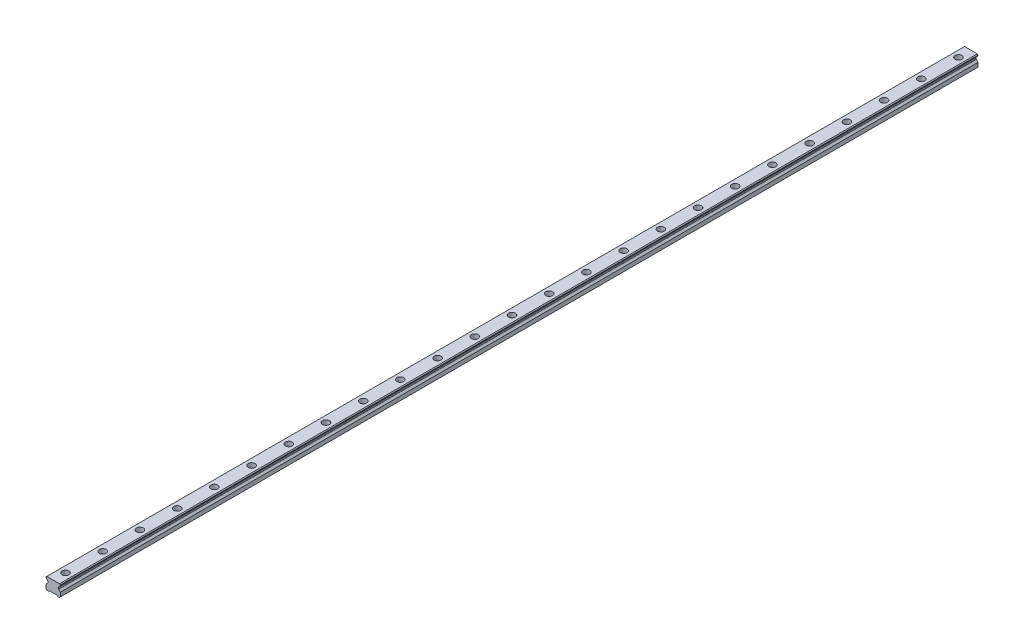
from build123d import *

# Parameters (mm, degrees)
SKETCH1_W           = 23
SKETCH1_H           = 19.2
BOSS_EXTRUDE1_DEPTH = 740
CUT_EXTRUDE1_DEPTH  = 1481.169209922
CHAMFER1_SIZE       = 1.25
FILLET1_R           = 1.25
CUT_EXTRUDE2_DEPTH  = 1481.169209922
SKETCH4_R           = 5.5
SKETCH4_R_2         = 3.5
CUT_EXTRUDE3_DEPTH  = 9
SKETCH4_2_R         = 3.5
CUT_EXTRUDE4_DEPTH  = 741.338361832
LPATTERN1_COUNT     = 25
LPATTERN1_PITCH     = 60


with BuildPart() as part:
    # Sketch1 → Boss-Extrude1 (new, symmetric)
    with BuildSketch(Plane.XY):
        with Locations((0, 9.6)):
            Rectangle(SKETCH1_W, SKETCH1_H)
    extrude(amount=BOSS_EXTRUDE1_DEPTH, both=True)

    # Sketch2 → Cut-Extrude1 (cut, through all)
    with BuildSketch(Plane.XY.offset(740)):
        Polygon((-11.5, 16.7), (-11.5, 7.95), (-8.583333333, 10.866666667), (-8.583333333, 13.783333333), align=None)
        Polygon((8.583333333, 13.783333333), (11.5, 16.7), (11.5, 7.95), (8.583333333, 10.866666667), align=None)
    extrude(amount=-CUT_EXTRUDE1_DEPTH, mode=Mode.SUBTRACT)

    # Chamfer1
    chamfer1_edges = [part.edges().sort_by_distance(p)[0] for p in [
        (-11.5, 19.2, 0),
        (11.5, 19.2, 0),
        (11.5, 0, 0),
        (-11.5, 0, 0),
    ]]
    chamfer(chamfer1_edges, length=CHAMFER1_SIZE)

    # Fillet1
    fillet1_edges = [part.edges().sort_by_distance(p)[0] for p in [
        (-8.583333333, 13.783333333, 0),
        (-8.583333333, 10.866666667, 0),
        (8.583333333, 10.866666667, 0),
        (8.583333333, 13.783333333, 0),
    ]]
    fillet(fillet1_edges, radius=FILLET1_R)

    # Sketch3 → Cut-Extrude2 (cut, through all)
    with BuildSketch(Plane.XY.offset(740)):
        Polygon((-7, 0), (-5.75, 1.25), (5.75, 1.25), (7, 0), align=None)
    extrude(amount=-CUT_EXTRUDE2_DEPTH, mode=Mode.SUBTRACT)

    # Sketch4 → Cut-Extrude3 (cut)
    with BuildSketch(Plane(origin=(0, 19.2, 0), x_dir=(1, 0, 0), z_dir=(0, 1, 0))):
        with Locations(Location((0, -720, 0), (0, 0, 270))):
            Circle(SKETCH4_R)
        with Locations(Location((0, -720, 0), (0, 0, 270))):
            Circle(SKETCH4_R_2, mode=Mode.SUBTRACT)
    cut_extrude3 = extrude(amount=-CUT_EXTRUDE3_DEPTH, mode=Mode.SUBTRACT)

    # Sketch4_2 → Cut-Extrude4 (cut, through all)
    with BuildSketch(Plane(origin=(0, 19.2, 0), x_dir=(1, 0, 0), z_dir=(0, 1, 0))):
        with Locations(Location((0, -720, 0), (0, 0, 270))):
            Circle(SKETCH4_2_R)
    cut_extrude4 = extrude(amount=-CUT_EXTRUDE4_DEPTH, mode=Mode.SUBTRACT)

    # LPattern1: Cut-Extrude3, Cut-Extrude4 ×25
    with Locations(*[(0, 0, -i * LPATTERN1_PITCH) for i in range(1, LPATTERN1_COUNT)]):
        add(cut_extrude3, mode=Mode.SUBTRACT)
        add(cut_extrude4, mode=Mode.SUBTRACT)


solid = part.part
